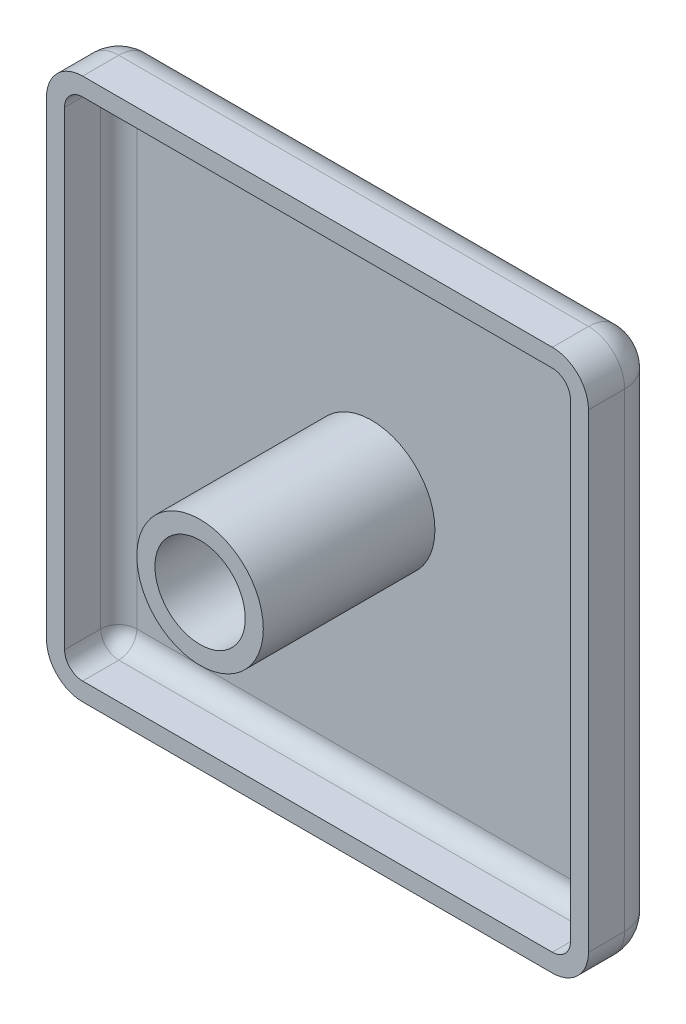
from build123d import *

# Parameters (mm, degrees)
SKETCH_1_W      = 30
SKETCH_1_H      = 30
EXTRUDE_1_DEPTH = 2
FILLET_1_R      = 2
SHELL_1_T       = -1
SKETCH_2_R      = 3.5
SKETCH_2_R_2    = 2.5
EXTRUDE_2_DEPTH = 9.5


with BuildPart() as part:
    # Sketch 1 → Extrude 1 (new, symmetric)
    with BuildSketch(Plane.XY):
        Rectangle(SKETCH_1_W, SKETCH_1_H)
    extrude(amount=EXTRUDE_1_DEPTH, both=True)

    # Fillet 1
    fillet_1_edges = [part.edges().sort_by_distance(p)[0] for p in [
        (0, 15, -2),
        (15, 0, -2),
        (0, -15, -2),
        (-15, 0, -2),
        (-15, 15, 0),
        (15, 15, 0),
        (15, -15, 0),
        (-15, -15, 0),
    ]]
    fillet(fillet_1_edges, radius=FILLET_1_R)

    # Shell 1
    shell_1_openings = [part.faces().sort_by_distance(p)[0] for p in [
        (0, 0, 2),
    ]]
    offset(amount=SHELL_1_T, openings=shell_1_openings, kind=Kind.INTERSECTION)

    # Sketch 2 → Extrude 2 (add)
    with BuildSketch(Plane.XY.offset(-1)):
        Circle(SKETCH_2_R)
        Circle(SKETCH_2_R_2, mode=Mode.SUBTRACT)
    extrude(amount=EXTRUDE_2_DEPTH)


solid = part.part
